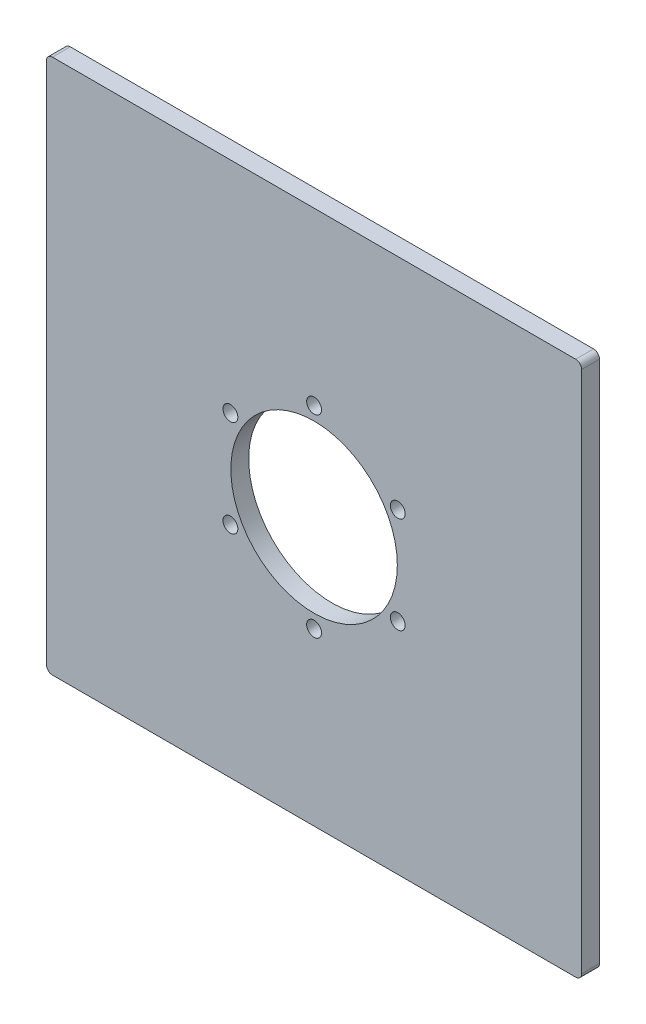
from build123d import *

# Parameters (mm, degrees)
SKETCH1_W           = 228.6
SKETCH1_H           = 228.6
BOSS_EXTRUDE1_DEPTH = 7.62
FILLET1_R           = 2.54
SKETCH2_R           = 35.56
CUT_EXTRUDE1_DEPTH  = 7.62
SKETCH3_R           = 3.175
CUT_EXTRUDE2_DEPTH  = 7.62
CIRPATTERN1_COUNT   = 6


with BuildPart() as part:
    # Sketch1 → Boss-Extrude1 (new body)
    with BuildSketch(Plane.XY):
        Rectangle(SKETCH1_W, SKETCH1_H)
    extrude(amount=BOSS_EXTRUDE1_DEPTH)

    # Fillet1
    fillet1_edges = [part.edges().sort_by_distance(p)[0] for p in [
        (114.3, -114.3, 3.81),
        (-114.3, -114.3, 3.81),
        (-114.3, 114.3, 3.81),
        (114.3, 114.3, 3.81),
    ]]
    fillet(fillet1_edges, radius=FILLET1_R)

    # Sketch2 → Cut-Extrude1 (cut)
    with BuildSketch(Plane.XY.offset(7.62)):
        Circle(SKETCH2_R)
    extrude(amount=-CUT_EXTRUDE1_DEPTH, mode=Mode.SUBTRACT)

    # Sketch3 → Cut-Extrude2 (cut)
    with BuildSketch(Plane.XY.offset(7.62)):
        with Locations((0, 41.275)):
            Circle(SKETCH3_R)
    cut_extrude2 = extrude(amount=-CUT_EXTRUDE2_DEPTH, mode=Mode.SUBTRACT)

    # CirPattern1: Cut-Extrude2 ×6 about axis
    cirpattern1_axis = Axis((0, 0, 0), (0, 0, 1))
    for i in range(1, CIRPATTERN1_COUNT):
        add(cut_extrude2.rotate(cirpattern1_axis, i * 360 / CIRPATTERN1_COUNT), mode=Mode.SUBTRACT)


solid = part.part
